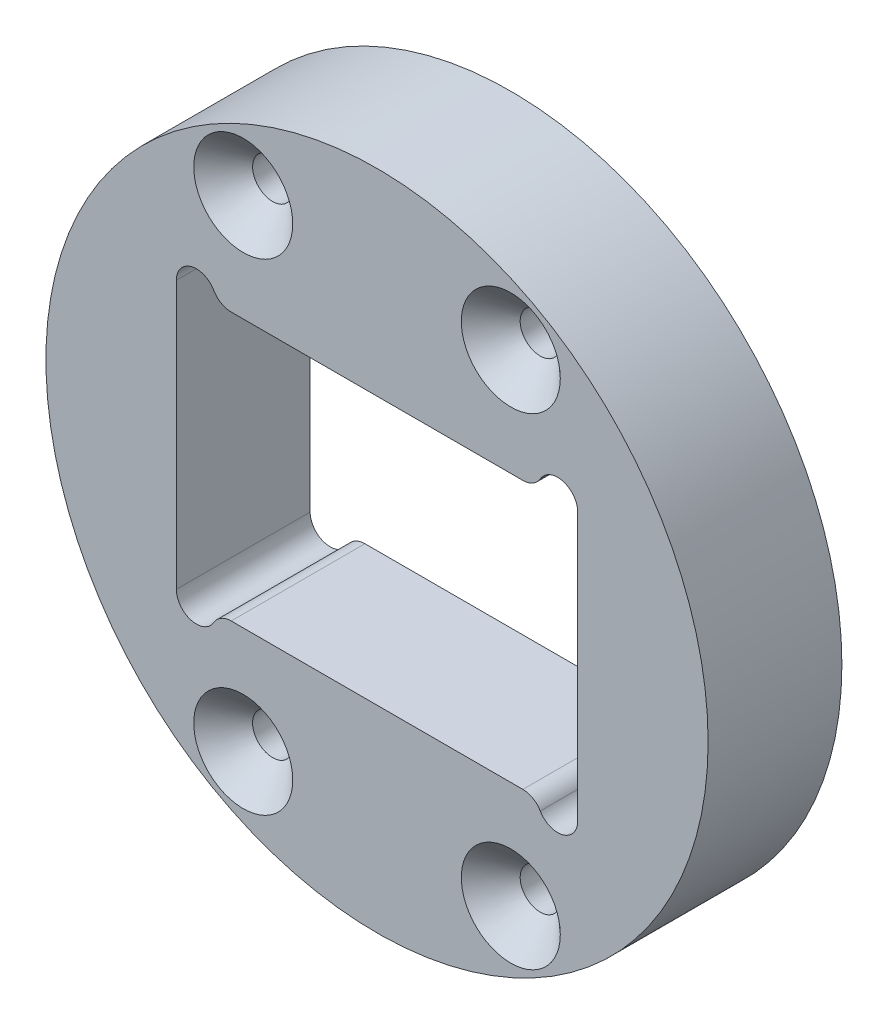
ISO-10303-21;
HEADER;
FILE_DESCRIPTION(('STEP AP214'),'2;1');
FILE_NAME('part.step','',(''),(''),'','','');
FILE_SCHEMA(('AUTOMOTIVE_DESIGN { 1 0 10303 214 1 1 1 1 }'));
ENDSEC;
DATA;
#1=APPLICATION_CONTEXT('core data for automotive mechanical design processes');
#2=APPLICATION_PROTOCOL_DEFINITION('international standard','automotive_design',2000,#1);
#3=PRODUCT_CONTEXT('',#1,'mechanical');
#4=PRODUCT('Part','Part','',(#3));
#5=PRODUCT_RELATED_PRODUCT_CATEGORY('part','',(#4));
#6=PRODUCT_DEFINITION_FORMATION('','',#4);
#7=PRODUCT_DEFINITION_CONTEXT('part definition',#1,'design');
#8=PRODUCT_DEFINITION('design','',#6,#7);
#9=PRODUCT_DEFINITION_SHAPE('','',#8);
#10=(LENGTH_UNIT() NAMED_UNIT(*) SI_UNIT(.MILLI.,.METRE.));
#11=(NAMED_UNIT(*) PLANE_ANGLE_UNIT() SI_UNIT($,.RADIAN.));
#12=(NAMED_UNIT(*) SI_UNIT($,.STERADIAN.) SOLID_ANGLE_UNIT());
#13=UNCERTAINTY_MEASURE_WITH_UNIT(LENGTH_MEASURE(1.E-05),#10,'distance_accuracy_value','');
#14=(GEOMETRIC_REPRESENTATION_CONTEXT(3) GLOBAL_UNCERTAINTY_ASSIGNED_CONTEXT((#13)) GLOBAL_UNIT_ASSIGNED_CONTEXT((#10,
#11,#12)) REPRESENTATION_CONTEXT('',''));
#15=CARTESIAN_POINT('',(0.,0.,0.));
#16=DIRECTION('',(0.,0.,1.));
#17=DIRECTION('',(1.,0.,0.));
#18=AXIS2_PLACEMENT_3D('',#15,#16,#17);
#19=CARTESIAN_POINT('',(0.,0.,10.));
#20=DIRECTION('',(0.,0.,1.));
#21=DIRECTION('',(1.,0.,0.));
#22=AXIS2_PLACEMENT_3D('',#19,#20,#21);
#23=PLANE('',#22);
#24=CARTESIAN_POINT('',(-10.,-18.,10.));
#25=DIRECTION('',(0.,0.,1.));
#26=DIRECTION('',(1.,0.,0.));
#27=AXIS2_PLACEMENT_3D('',#24,#25,#26);
#28=CIRCLE('',#27,3.70000000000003);
#29=CARTESIAN_POINT('',(-6.29999999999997,-18.,10.));
#30=VERTEX_POINT('',#29);
#31=EDGE_CURVE('E291',#30,#30,#28,.F.);
#32=ORIENTED_EDGE('',*,*,#31,.T.);
#33=EDGE_LOOP('',(#32));
#34=FACE_BOUND('',#33,.T.);
#35=CARTESIAN_POINT('',(10.,-18.,10.));
#36=DIRECTION('',(0.,0.,1.));
#37=DIRECTION('',(1.,0.,0.));
#38=AXIS2_PLACEMENT_3D('',#35,#36,#37);
#39=CIRCLE('',#38,3.70000000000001);
#40=CARTESIAN_POINT('',(13.7,-18.,10.));
#41=VERTEX_POINT('',#40);
#42=EDGE_CURVE('E287',#41,#41,#39,.F.);
#43=ORIENTED_EDGE('',*,*,#42,.T.);
#44=EDGE_LOOP('',(#43));
#45=FACE_BOUND('',#44,.T.);
#46=CARTESIAN_POINT('',(10.,18.,10.));
#47=DIRECTION('',(0.,0.,1.));
#48=DIRECTION('',(1.,0.,0.));
#49=AXIS2_PLACEMENT_3D('',#46,#47,#48);
#50=CIRCLE('',#49,3.70000000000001);
#51=CARTESIAN_POINT('',(13.7,18.,10.));
#52=VERTEX_POINT('',#51);
#53=EDGE_CURVE('E283',#52,#52,#50,.F.);
#54=ORIENTED_EDGE('',*,*,#53,.T.);
#55=EDGE_LOOP('',(#54));
#56=FACE_BOUND('',#55,.T.);
#57=CARTESIAN_POINT('',(-10.,18.,10.));
#58=DIRECTION('',(0.,0.,1.));
#59=DIRECTION('',(1.,0.,0.));
#60=AXIS2_PLACEMENT_3D('',#57,#58,#59);
#61=CIRCLE('',#60,3.70000000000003);
#62=CARTESIAN_POINT('',(-6.29999999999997,18.,10.));
#63=VERTEX_POINT('',#62);
#64=EDGE_CURVE('E279',#63,#63,#61,.F.);
#65=ORIENTED_EDGE('',*,*,#64,.T.);
#66=EDGE_LOOP('',(#65));
#67=FACE_BOUND('',#66,.T.);
#68=CARTESIAN_POINT('',(0.,0.,10.));
#69=DIRECTION('',(0.,0.,1.));
#70=DIRECTION('',(1.,0.,0.));
#71=AXIS2_PLACEMENT_3D('',#68,#69,#70);
#72=CIRCLE('',#71,24.75);
#73=CARTESIAN_POINT('',(24.75,0.,10.));
#74=VERTEX_POINT('',#73);
#75=EDGE_CURVE('E268',#74,#74,#72,.T.);
#76=ORIENTED_EDGE('',*,*,#75,.T.);
#77=EDGE_LOOP('',(#76));
#78=FACE_BOUND('',#77,.T.);
#79=DIRECTION('',(0.,-1.,0.));
#80=VECTOR('',#79,1.);
#81=CARTESIAN_POINT('',(-15.,-10.0000000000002,10.));
#82=LINE('',#81,#80);
#83=CARTESIAN_POINT('',(-15.,10.,10.));
#84=VERTEX_POINT('',#83);
#85=CARTESIAN_POINT('',(-15.,-10.0000000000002,10.));
#86=VERTEX_POINT('',#85);
#87=EDGE_CURVE('E146',#84,#86,#82,.T.);
#88=ORIENTED_EDGE('',*,*,#87,.F.);
#89=CARTESIAN_POINT('',(-13.5,10.,10.));
#90=DIRECTION('',(0.,0.,1.));
#91=DIRECTION('',(1.,0.,0.));
#92=AXIS2_PLACEMENT_3D('',#89,#90,#91);
#93=CIRCLE('',#92,1.5);
#94=CARTESIAN_POINT('',(-12.2009618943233,10.75,10.));
#95=VERTEX_POINT('',#94);
#96=EDGE_CURVE('E137',#95,#84,#93,.T.);
#97=ORIENTED_EDGE('',*,*,#96,.F.);
#98=CARTESIAN_POINT('',(-10.9019237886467,11.5,10.));
#99=DIRECTION('',(0.,0.,-1.));
#100=DIRECTION('',(1.,0.,0.));
#101=AXIS2_PLACEMENT_3D('',#98,#99,#100);
#102=CIRCLE('',#101,1.5);
#103=CARTESIAN_POINT('',(-10.9019237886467,10.,10.));
#104=VERTEX_POINT('',#103);
#105=EDGE_CURVE('E191',#104,#95,#102,.T.);
#106=ORIENTED_EDGE('',*,*,#105,.F.);
#107=DIRECTION('',(-1.,0.,0.));
#108=VECTOR('',#107,1.);
#109=CARTESIAN_POINT('',(-10.9019237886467,10.,10.));
#110=LINE('',#109,#108);
#111=CARTESIAN_POINT('',(10.9019237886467,10.,10.));
#112=VERTEX_POINT('',#111);
#113=EDGE_CURVE('E188',#112,#104,#110,.T.);
#114=ORIENTED_EDGE('',*,*,#113,.F.);
#115=CARTESIAN_POINT('',(10.9019237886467,11.5,10.));
#116=DIRECTION('',(0.,0.,-1.));
#117=DIRECTION('',(1.,0.,0.));
#118=AXIS2_PLACEMENT_3D('',#115,#116,#117);
#119=CIRCLE('',#118,1.5);
#120=CARTESIAN_POINT('',(12.2009618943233,10.75,10.));
#121=VERTEX_POINT('',#120);
#122=EDGE_CURVE('E185',#121,#112,#119,.T.);
#123=ORIENTED_EDGE('',*,*,#122,.F.);
#124=CARTESIAN_POINT('',(13.5,10.,10.));
#125=DIRECTION('',(0.,0.,1.));
#126=DIRECTION('',(1.,0.,0.));
#127=AXIS2_PLACEMENT_3D('',#124,#125,#126);
#128=CIRCLE('',#127,1.5);
#129=CARTESIAN_POINT('',(15.,10.,10.));
#130=VERTEX_POINT('',#129);
#131=EDGE_CURVE('E182',#130,#121,#128,.T.);
#132=ORIENTED_EDGE('',*,*,#131,.F.);
#133=DIRECTION('',(0.,1.,0.));
#134=VECTOR('',#133,1.);
#135=CARTESIAN_POINT('',(15.,10.,10.));
#136=LINE('',#135,#134);
#137=CARTESIAN_POINT('',(15.,-10.0000000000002,10.));
#138=VERTEX_POINT('',#137);
#139=EDGE_CURVE('E179',#138,#130,#136,.T.);
#140=ORIENTED_EDGE('',*,*,#139,.F.);
#141=CARTESIAN_POINT('',(13.5,-10.0000000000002,10.));
#142=DIRECTION('',(0.,0.,1.));
#143=DIRECTION('',(1.,0.,0.));
#144=AXIS2_PLACEMENT_3D('',#141,#142,#143);
#145=CIRCLE('',#144,1.5);
#146=CARTESIAN_POINT('',(12.2009618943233,-10.7500000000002,10.));
#147=VERTEX_POINT('',#146);
#148=EDGE_CURVE('E176',#147,#138,#145,.T.);
#149=ORIENTED_EDGE('',*,*,#148,.F.);
#150=CARTESIAN_POINT('',(10.9019237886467,-11.5000000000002,10.));
#151=DIRECTION('',(0.,0.,-1.));
#152=DIRECTION('',(1.,0.,0.));
#153=AXIS2_PLACEMENT_3D('',#150,#151,#152);
#154=CIRCLE('',#153,1.5);
#155=CARTESIAN_POINT('',(10.9019237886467,-10.0000000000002,10.));
#156=VERTEX_POINT('',#155);
#157=EDGE_CURVE('E173',#156,#147,#154,.T.);
#158=ORIENTED_EDGE('',*,*,#157,.F.);
#159=DIRECTION('',(1.,0.,0.));
#160=VECTOR('',#159,1.);
#161=CARTESIAN_POINT('',(10.9019237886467,-10.0000000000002,10.));
#162=LINE('',#161,#160);
#163=CARTESIAN_POINT('',(-10.9019237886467,-10.0000000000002,10.));
#164=VERTEX_POINT('',#163);
#165=EDGE_CURVE('E170',#164,#156,#162,.T.);
#166=ORIENTED_EDGE('',*,*,#165,.F.);
#167=CARTESIAN_POINT('',(-10.9019237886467,-11.5000000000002,10.));
#168=DIRECTION('',(0.,0.,-1.));
#169=DIRECTION('',(1.,0.,0.));
#170=AXIS2_PLACEMENT_3D('',#167,#168,#169);
#171=CIRCLE('',#170,1.5);
#172=CARTESIAN_POINT('',(-12.2009618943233,-10.7500000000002,10.));
#173=VERTEX_POINT('',#172);
#174=EDGE_CURVE('E164',#173,#164,#171,.T.);
#175=ORIENTED_EDGE('',*,*,#174,.F.);
#176=CARTESIAN_POINT('',(-13.5,-10.0000000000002,10.));
#177=DIRECTION('',(0.,0.,1.));
#178=DIRECTION('',(1.,0.,0.));
#179=AXIS2_PLACEMENT_3D('',#176,#177,#178);
#180=CIRCLE('',#179,1.5);
#181=EDGE_CURVE('E160',#86,#173,#180,.T.);
#182=ORIENTED_EDGE('',*,*,#181,.F.);
#183=EDGE_LOOP('',(#88,#97,#106,#114,#123,#132,#140,#149,#158,#166,#175,#182));
#184=FACE_BOUND('',#183,.T.);
#185=ADVANCED_FACE('F46',(#34,#45,#56,#67,#78,#184),#23,.T.);
#186=CARTESIAN_POINT('',(0.,0.,0.));
#187=DIRECTION('',(0.,0.,1.));
#188=DIRECTION('',(1.,0.,0.));
#189=AXIS2_PLACEMENT_3D('',#186,#187,#188);
#190=PLANE('',#189);
#191=CARTESIAN_POINT('',(0.,0.,0.));
#192=DIRECTION('',(0.,0.,1.));
#193=DIRECTION('',(1.,0.,0.));
#194=AXIS2_PLACEMENT_3D('',#191,#192,#193);
#195=CIRCLE('',#194,24.75);
#196=CARTESIAN_POINT('',(24.75,0.,0.));
#197=VERTEX_POINT('',#196);
#198=EDGE_CURVE('E155',#197,#197,#195,.T.);
#199=ORIENTED_EDGE('',*,*,#198,.F.);
#200=EDGE_LOOP('',(#199));
#201=FACE_BOUND('',#200,.T.);
#202=CARTESIAN_POINT('',(-13.5,10.,0.));
#203=DIRECTION('',(0.,0.,1.));
#204=DIRECTION('',(1.,0.,0.));
#205=AXIS2_PLACEMENT_3D('',#202,#203,#204);
#206=CIRCLE('',#205,1.5);
#207=CARTESIAN_POINT('',(-12.2009618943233,10.75,0.));
#208=VERTEX_POINT('',#207);
#209=CARTESIAN_POINT('',(-15.,10.,0.));
#210=VERTEX_POINT('',#209);
#211=EDGE_CURVE('E71',#208,#210,#206,.T.);
#212=ORIENTED_EDGE('',*,*,#211,.T.);
#213=DIRECTION('',(0.,-1.,0.));
#214=VECTOR('',#213,1.);
#215=CARTESIAN_POINT('',(-15.,-10.0000000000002,0.));
#216=LINE('',#215,#214);
#217=CARTESIAN_POINT('',(-15.,-10.0000000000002,0.));
#218=VERTEX_POINT('',#217);
#219=EDGE_CURVE('E153',#210,#218,#216,.T.);
#220=ORIENTED_EDGE('',*,*,#219,.T.);
#221=CARTESIAN_POINT('',(-13.5,-10.0000000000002,0.));
#222=DIRECTION('',(0.,0.,1.));
#223=DIRECTION('',(1.,0.,0.));
#224=AXIS2_PLACEMENT_3D('',#221,#222,#223);
#225=CIRCLE('',#224,1.5);
#226=CARTESIAN_POINT('',(-12.2009618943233,-10.7500000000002,0.));
#227=VERTEX_POINT('',#226);
#228=EDGE_CURVE('E199',#218,#227,#225,.T.);
#229=ORIENTED_EDGE('',*,*,#228,.T.);
#230=CARTESIAN_POINT('',(-10.9019237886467,-11.5000000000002,0.));
#231=DIRECTION('',(0.,0.,-1.));
#232=DIRECTION('',(1.,0.,0.));
#233=AXIS2_PLACEMENT_3D('',#230,#231,#232);
#234=CIRCLE('',#233,1.5);
#235=CARTESIAN_POINT('',(-10.9019237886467,-10.0000000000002,0.));
#236=VERTEX_POINT('',#235);
#237=EDGE_CURVE('E203',#227,#236,#234,.T.);
#238=ORIENTED_EDGE('',*,*,#237,.T.);
#239=DIRECTION('',(1.,0.,0.));
#240=VECTOR('',#239,1.);
#241=CARTESIAN_POINT('',(10.9019237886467,-10.0000000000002,0.));
#242=LINE('',#241,#240);
#243=CARTESIAN_POINT('',(10.9019237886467,-10.0000000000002,0.));
#244=VERTEX_POINT('',#243);
#245=EDGE_CURVE('E207',#236,#244,#242,.T.);
#246=ORIENTED_EDGE('',*,*,#245,.T.);
#247=CARTESIAN_POINT('',(10.9019237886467,-11.5000000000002,0.));
#248=DIRECTION('',(0.,0.,-1.));
#249=DIRECTION('',(1.,0.,0.));
#250=AXIS2_PLACEMENT_3D('',#247,#248,#249);
#251=CIRCLE('',#250,1.5);
#252=CARTESIAN_POINT('',(12.2009618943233,-10.7500000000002,0.));
#253=VERTEX_POINT('',#252);
#254=EDGE_CURVE('E211',#244,#253,#251,.T.);
#255=ORIENTED_EDGE('',*,*,#254,.T.);
#256=CARTESIAN_POINT('',(13.5,-10.0000000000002,0.));
#257=DIRECTION('',(0.,0.,1.));
#258=DIRECTION('',(1.,0.,0.));
#259=AXIS2_PLACEMENT_3D('',#256,#257,#258);
#260=CIRCLE('',#259,1.5);
#261=CARTESIAN_POINT('',(15.,-10.0000000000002,0.));
#262=VERTEX_POINT('',#261);
#263=EDGE_CURVE('E215',#253,#262,#260,.T.);
#264=ORIENTED_EDGE('',*,*,#263,.T.);
#265=DIRECTION('',(0.,1.,0.));
#266=VECTOR('',#265,1.);
#267=CARTESIAN_POINT('',(15.,10.,0.));
#268=LINE('',#267,#266);
#269=CARTESIAN_POINT('',(15.,10.,0.));
#270=VERTEX_POINT('',#269);
#271=EDGE_CURVE('E219',#262,#270,#268,.T.);
#272=ORIENTED_EDGE('',*,*,#271,.T.);
#273=CARTESIAN_POINT('',(13.5,10.,0.));
#274=DIRECTION('',(0.,0.,1.));
#275=DIRECTION('',(1.,0.,0.));
#276=AXIS2_PLACEMENT_3D('',#273,#274,#275);
#277=CIRCLE('',#276,1.5);
#278=CARTESIAN_POINT('',(12.2009618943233,10.75,0.));
#279=VERTEX_POINT('',#278);
#280=EDGE_CURVE('E223',#270,#279,#277,.T.);
#281=ORIENTED_EDGE('',*,*,#280,.T.);
#282=CARTESIAN_POINT('',(10.9019237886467,11.5,0.));
#283=DIRECTION('',(0.,0.,-1.));
#284=DIRECTION('',(1.,0.,0.));
#285=AXIS2_PLACEMENT_3D('',#282,#283,#284);
#286=CIRCLE('',#285,1.5);
#287=CARTESIAN_POINT('',(10.9019237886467,10.,0.));
#288=VERTEX_POINT('',#287);
#289=EDGE_CURVE('E227',#279,#288,#286,.T.);
#290=ORIENTED_EDGE('',*,*,#289,.T.);
#291=DIRECTION('',(-1.,0.,0.));
#292=VECTOR('',#291,1.);
#293=CARTESIAN_POINT('',(-10.9019237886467,10.,0.));
#294=LINE('',#293,#292);
#295=CARTESIAN_POINT('',(-10.9019237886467,10.,0.));
#296=VERTEX_POINT('',#295);
#297=EDGE_CURVE('E231',#288,#296,#294,.T.);
#298=ORIENTED_EDGE('',*,*,#297,.T.);
#299=CARTESIAN_POINT('',(-10.9019237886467,11.5,0.));
#300=DIRECTION('',(0.,0.,-1.));
#301=DIRECTION('',(1.,0.,0.));
#302=AXIS2_PLACEMENT_3D('',#299,#300,#301);
#303=CIRCLE('',#302,1.5);
#304=EDGE_CURVE('E147',#296,#208,#303,.T.);
#305=ORIENTED_EDGE('',*,*,#304,.T.);
#306=EDGE_LOOP('',(#212,#220,#229,#238,#246,#255,#264,#272,#281,#290,#298,#305));
#307=FACE_BOUND('',#306,.T.);
#308=CARTESIAN_POINT('',(10.,18.,0.));
#309=DIRECTION('',(0.,0.,1.));
#310=DIRECTION('',(1.,0.,0.));
#311=AXIS2_PLACEMENT_3D('',#308,#309,#310);
#312=CIRCLE('',#311,1.5);
#313=CARTESIAN_POINT('',(11.5,18.,0.));
#314=VERTEX_POINT('',#313);
#315=EDGE_CURVE('E196',#314,#314,#312,.T.);
#316=ORIENTED_EDGE('',*,*,#315,.T.);
#317=EDGE_LOOP('',(#316));
#318=FACE_BOUND('',#317,.T.);
#319=CARTESIAN_POINT('',(10.,-18.,0.));
#320=DIRECTION('',(0.,0.,1.));
#321=DIRECTION('',(-1.,0.,0.));
#322=AXIS2_PLACEMENT_3D('',#319,#320,#321);
#323=CIRCLE('',#322,1.5);
#324=CARTESIAN_POINT('',(8.49999999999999,-18.,0.));
#325=VERTEX_POINT('',#324);
#326=EDGE_CURVE('E370',#325,#325,#323,.T.);
#327=ORIENTED_EDGE('',*,*,#326,.T.);
#328=EDGE_LOOP('',(#327));
#329=FACE_BOUND('',#328,.T.);
#330=CARTESIAN_POINT('',(-10.,18.,0.));
#331=DIRECTION('',(0.,0.,1.));
#332=DIRECTION('',(1.,0.,0.));
#333=AXIS2_PLACEMENT_3D('',#330,#331,#332);
#334=CIRCLE('',#333,1.5);
#335=CARTESIAN_POINT('',(-8.49999999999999,18.,0.));
#336=VERTEX_POINT('',#335);
#337=EDGE_CURVE('E366',#336,#336,#334,.T.);
#338=ORIENTED_EDGE('',*,*,#337,.T.);
#339=EDGE_LOOP('',(#338));
#340=FACE_BOUND('',#339,.T.);
#341=CARTESIAN_POINT('',(-10.,-18.,0.));
#342=DIRECTION('',(0.,0.,1.));
#343=DIRECTION('',(-1.,0.,0.));
#344=AXIS2_PLACEMENT_3D('',#341,#342,#343);
#345=CIRCLE('',#344,1.5);
#346=CARTESIAN_POINT('',(-11.5,-18.,0.));
#347=VERTEX_POINT('',#346);
#348=EDGE_CURVE('E363',#347,#347,#345,.T.);
#349=ORIENTED_EDGE('',*,*,#348,.T.);
#350=EDGE_LOOP('',(#349));
#351=FACE_BOUND('',#350,.T.);
#352=ADVANCED_FACE('F320',(#201,#307,#318,#329,#340,#351),#190,.F.);
#353=CARTESIAN_POINT('',(0.,0.,10.));
#354=DIRECTION('',(0.,0.,-1.));
#355=DIRECTION('',(-1.,0.,0.));
#356=AXIS2_PLACEMENT_3D('',#353,#354,#355);
#357=CYLINDRICAL_SURFACE('',#356,24.75);
#358=ORIENTED_EDGE('',*,*,#75,.F.);
#359=EDGE_LOOP('',(#358));
#360=FACE_BOUND('',#359,.T.);
#361=ORIENTED_EDGE('',*,*,#198,.T.);
#362=EDGE_LOOP('',(#361));
#363=FACE_BOUND('',#362,.T.);
#364=ADVANCED_FACE('F328',(#360,#363),#357,.T.);
#365=CARTESIAN_POINT('',(-13.5,10.,10.));
#366=DIRECTION('',(0.,0.,-1.));
#367=DIRECTION('',(-1.,0.,0.));
#368=AXIS2_PLACEMENT_3D('',#365,#366,#367);
#369=CYLINDRICAL_SURFACE('',#368,1.5);
#370=ORIENTED_EDGE('',*,*,#211,.F.);
#371=DIRECTION('',(0.,0.,-1.));
#372=VECTOR('',#371,1.);
#373=CARTESIAN_POINT('',(-12.2009618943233,10.75,10.));
#374=LINE('',#373,#372);
#375=EDGE_CURVE('E141',#95,#208,#374,.T.);
#376=ORIENTED_EDGE('',*,*,#375,.F.);
#377=ORIENTED_EDGE('',*,*,#96,.T.);
#378=DIRECTION('',(0.,0.,-1.));
#379=VECTOR('',#378,1.);
#380=CARTESIAN_POINT('',(-15.,10.,10.));
#381=LINE('',#380,#379);
#382=EDGE_CURVE('E140',#84,#210,#381,.T.);
#383=ORIENTED_EDGE('',*,*,#382,.T.);
#384=EDGE_LOOP('',(#370,#376,#377,#383));
#385=FACE_BOUND('',#384,.T.);
#386=ADVANCED_FACE('F139',(#385),#369,.F.);
#387=CARTESIAN_POINT('',(-15.,-10.0000000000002,10.));
#388=DIRECTION('',(1.,0.,0.));
#389=DIRECTION('',(0.,0.,-1.));
#390=AXIS2_PLACEMENT_3D('',#387,#388,#389);
#391=PLANE('',#390);
#392=ORIENTED_EDGE('',*,*,#219,.F.);
#393=ORIENTED_EDGE('',*,*,#382,.F.);
#394=ORIENTED_EDGE('',*,*,#87,.T.);
#395=DIRECTION('',(0.,0.,-1.));
#396=VECTOR('',#395,1.);
#397=CARTESIAN_POINT('',(-15.,-10.0000000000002,10.));
#398=LINE('',#397,#396);
#399=EDGE_CURVE('E156',#86,#218,#398,.T.);
#400=ORIENTED_EDGE('',*,*,#399,.T.);
#401=EDGE_LOOP('',(#392,#393,#394,#400));
#402=FACE_BOUND('',#401,.T.);
#403=ADVANCED_FACE('F150',(#402),#391,.T.);
#404=CARTESIAN_POINT('',(-13.5,-10.0000000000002,10.));
#405=DIRECTION('',(0.,0.,-1.));
#406=DIRECTION('',(-1.,0.,0.));
#407=AXIS2_PLACEMENT_3D('',#404,#405,#406);
#408=CYLINDRICAL_SURFACE('',#407,1.5);
#409=ORIENTED_EDGE('',*,*,#228,.F.);
#410=ORIENTED_EDGE('',*,*,#399,.F.);
#411=ORIENTED_EDGE('',*,*,#181,.T.);
#412=DIRECTION('',(0.,0.,-1.));
#413=VECTOR('',#412,1.);
#414=CARTESIAN_POINT('',(-12.2009618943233,-10.7500000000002,10.));
#415=LINE('',#414,#413);
#416=EDGE_CURVE('E263',#173,#227,#415,.T.);
#417=ORIENTED_EDGE('',*,*,#416,.T.);
#418=EDGE_LOOP('',(#409,#410,#411,#417));
#419=FACE_BOUND('',#418,.T.);
#420=ADVANCED_FACE('F422',(#419),#408,.F.);
#421=CARTESIAN_POINT('',(-10.9019237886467,-11.5000000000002,10.));
#422=DIRECTION('',(0.,0.,-1.));
#423=DIRECTION('',(-1.,0.,0.));
#424=AXIS2_PLACEMENT_3D('',#421,#422,#423);
#425=CYLINDRICAL_SURFACE('',#424,1.5);
#426=ORIENTED_EDGE('',*,*,#237,.F.);
#427=ORIENTED_EDGE('',*,*,#416,.F.);
#428=ORIENTED_EDGE('',*,*,#174,.T.);
#429=DIRECTION('',(0.,0.,-1.));
#430=VECTOR('',#429,1.);
#431=CARTESIAN_POINT('',(-10.9019237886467,-10.0000000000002,10.));
#432=LINE('',#431,#430);
#433=EDGE_CURVE('E260',#164,#236,#432,.T.);
#434=ORIENTED_EDGE('',*,*,#433,.T.);
#435=EDGE_LOOP('',(#426,#427,#428,#434));
#436=FACE_BOUND('',#435,.T.);
#437=ADVANCED_FACE('F418',(#436),#425,.T.);
#438=CARTESIAN_POINT('',(10.9019237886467,-10.0000000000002,10.));
#439=DIRECTION('',(0.,1.,0.));
#440=DIRECTION('',(-1.,0.,0.));
#441=AXIS2_PLACEMENT_3D('',#438,#439,#440);
#442=PLANE('',#441);
#443=ORIENTED_EDGE('',*,*,#245,.F.);
#444=ORIENTED_EDGE('',*,*,#433,.F.);
#445=ORIENTED_EDGE('',*,*,#165,.T.);
#446=DIRECTION('',(0.,0.,-1.));
#447=VECTOR('',#446,1.);
#448=CARTESIAN_POINT('',(10.9019237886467,-10.0000000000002,10.));
#449=LINE('',#448,#447);
#450=EDGE_CURVE('E257',#156,#244,#449,.T.);
#451=ORIENTED_EDGE('',*,*,#450,.T.);
#452=EDGE_LOOP('',(#443,#444,#445,#451));
#453=FACE_BOUND('',#452,.T.);
#454=ADVANCED_FACE('F414',(#453),#442,.T.);
#455=CARTESIAN_POINT('',(10.9019237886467,-11.5000000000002,10.));
#456=DIRECTION('',(0.,0.,-1.));
#457=DIRECTION('',(-1.,0.,0.));
#458=AXIS2_PLACEMENT_3D('',#455,#456,#457);
#459=CYLINDRICAL_SURFACE('',#458,1.5);
#460=ORIENTED_EDGE('',*,*,#254,.F.);
#461=ORIENTED_EDGE('',*,*,#450,.F.);
#462=ORIENTED_EDGE('',*,*,#157,.T.);
#463=DIRECTION('',(0.,0.,-1.));
#464=VECTOR('',#463,1.);
#465=CARTESIAN_POINT('',(12.2009618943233,-10.7500000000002,10.));
#466=LINE('',#465,#464);
#467=EDGE_CURVE('E254',#147,#253,#466,.T.);
#468=ORIENTED_EDGE('',*,*,#467,.T.);
#469=EDGE_LOOP('',(#460,#461,#462,#468));
#470=FACE_BOUND('',#469,.T.);
#471=ADVANCED_FACE('F410',(#470),#459,.T.);
#472=CARTESIAN_POINT('',(13.5,-10.0000000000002,10.));
#473=DIRECTION('',(0.,0.,-1.));
#474=DIRECTION('',(-1.,0.,0.));
#475=AXIS2_PLACEMENT_3D('',#472,#473,#474);
#476=CYLINDRICAL_SURFACE('',#475,1.5);
#477=ORIENTED_EDGE('',*,*,#263,.F.);
#478=ORIENTED_EDGE('',*,*,#467,.F.);
#479=ORIENTED_EDGE('',*,*,#148,.T.);
#480=DIRECTION('',(0.,0.,-1.));
#481=VECTOR('',#480,1.);
#482=CARTESIAN_POINT('',(15.,-10.0000000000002,10.));
#483=LINE('',#482,#481);
#484=EDGE_CURVE('E251',#138,#262,#483,.T.);
#485=ORIENTED_EDGE('',*,*,#484,.T.);
#486=EDGE_LOOP('',(#477,#478,#479,#485));
#487=FACE_BOUND('',#486,.T.);
#488=ADVANCED_FACE('F406',(#487),#476,.F.);
#489=CARTESIAN_POINT('',(15.,10.,10.));
#490=DIRECTION('',(-1.,0.,0.));
#491=DIRECTION('',(0.,-1.,0.));
#492=AXIS2_PLACEMENT_3D('',#489,#490,#491);
#493=PLANE('',#492);
#494=ORIENTED_EDGE('',*,*,#271,.F.);
#495=ORIENTED_EDGE('',*,*,#484,.F.);
#496=ORIENTED_EDGE('',*,*,#139,.T.);
#497=DIRECTION('',(0.,0.,-1.));
#498=VECTOR('',#497,1.);
#499=CARTESIAN_POINT('',(15.,10.,10.));
#500=LINE('',#499,#498);
#501=EDGE_CURVE('E248',#130,#270,#500,.T.);
#502=ORIENTED_EDGE('',*,*,#501,.T.);
#503=EDGE_LOOP('',(#494,#495,#496,#502));
#504=FACE_BOUND('',#503,.T.);
#505=ADVANCED_FACE('F402',(#504),#493,.T.);
#506=CARTESIAN_POINT('',(13.5,10.,10.));
#507=DIRECTION('',(0.,0.,-1.));
#508=DIRECTION('',(-1.,0.,0.));
#509=AXIS2_PLACEMENT_3D('',#506,#507,#508);
#510=CYLINDRICAL_SURFACE('',#509,1.5);
#511=ORIENTED_EDGE('',*,*,#280,.F.);
#512=ORIENTED_EDGE('',*,*,#501,.F.);
#513=ORIENTED_EDGE('',*,*,#131,.T.);
#514=DIRECTION('',(0.,0.,-1.));
#515=VECTOR('',#514,1.);
#516=CARTESIAN_POINT('',(12.2009618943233,10.75,10.));
#517=LINE('',#516,#515);
#518=EDGE_CURVE('E245',#121,#279,#517,.T.);
#519=ORIENTED_EDGE('',*,*,#518,.T.);
#520=EDGE_LOOP('',(#511,#512,#513,#519));
#521=FACE_BOUND('',#520,.T.);
#522=ADVANCED_FACE('F398',(#521),#510,.F.);
#523=CARTESIAN_POINT('',(10.9019237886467,11.5,10.));
#524=DIRECTION('',(0.,0.,-1.));
#525=DIRECTION('',(-1.,0.,0.));
#526=AXIS2_PLACEMENT_3D('',#523,#524,#525);
#527=CYLINDRICAL_SURFACE('',#526,1.5);
#528=ORIENTED_EDGE('',*,*,#289,.F.);
#529=ORIENTED_EDGE('',*,*,#518,.F.);
#530=ORIENTED_EDGE('',*,*,#122,.T.);
#531=DIRECTION('',(0.,0.,-1.));
#532=VECTOR('',#531,1.);
#533=CARTESIAN_POINT('',(10.9019237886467,10.,10.));
#534=LINE('',#533,#532);
#535=EDGE_CURVE('E242',#112,#288,#534,.T.);
#536=ORIENTED_EDGE('',*,*,#535,.T.);
#537=EDGE_LOOP('',(#528,#529,#530,#536));
#538=FACE_BOUND('',#537,.T.);
#539=ADVANCED_FACE('F394',(#538),#527,.T.);
#540=CARTESIAN_POINT('',(-10.9019237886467,10.,10.));
#541=DIRECTION('',(0.,-1.,0.));
#542=DIRECTION('',(1.,0.,0.));
#543=AXIS2_PLACEMENT_3D('',#540,#541,#542);
#544=PLANE('',#543);
#545=ORIENTED_EDGE('',*,*,#297,.F.);
#546=ORIENTED_EDGE('',*,*,#535,.F.);
#547=ORIENTED_EDGE('',*,*,#113,.T.);
#548=DIRECTION('',(0.,0.,-1.));
#549=VECTOR('',#548,1.);
#550=CARTESIAN_POINT('',(-10.9019237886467,10.,10.));
#551=LINE('',#550,#549);
#552=EDGE_CURVE('E63',#104,#296,#551,.T.);
#553=ORIENTED_EDGE('',*,*,#552,.T.);
#554=EDGE_LOOP('',(#545,#546,#547,#553));
#555=FACE_BOUND('',#554,.T.);
#556=ADVANCED_FACE('F388',(#555),#544,.T.);
#557=CARTESIAN_POINT('',(-10.9019237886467,11.5,10.));
#558=DIRECTION('',(0.,0.,-1.));
#559=DIRECTION('',(-1.,0.,0.));
#560=AXIS2_PLACEMENT_3D('',#557,#558,#559);
#561=CYLINDRICAL_SURFACE('',#560,1.5);
#562=ORIENTED_EDGE('',*,*,#304,.F.);
#563=ORIENTED_EDGE('',*,*,#552,.F.);
#564=ORIENTED_EDGE('',*,*,#105,.T.);
#565=ORIENTED_EDGE('',*,*,#375,.T.);
#566=EDGE_LOOP('',(#562,#563,#564,#565));
#567=FACE_BOUND('',#566,.T.);
#568=ADVANCED_FACE('F381',(#567),#561,.T.);
#569=CARTESIAN_POINT('',(10.,18.,10.));
#570=DIRECTION('',(0.,0.,-1.));
#571=DIRECTION('',(-1.,0.,0.));
#572=AXIS2_PLACEMENT_3D('',#569,#570,#571);
#573=CYLINDRICAL_SURFACE('',#572,1.5);
#574=CARTESIAN_POINT('',(10.,18.,7.80000000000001));
#575=DIRECTION('',(0.,0.,1.));
#576=DIRECTION('',(1.,0.,0.));
#577=AXIS2_PLACEMENT_3D('',#574,#575,#576);
#578=CIRCLE('',#577,1.5);
#579=CARTESIAN_POINT('',(11.5,18.,7.80000000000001));
#580=VERTEX_POINT('',#579);
#581=EDGE_CURVE('E56',#580,#580,#578,.T.);
#582=ORIENTED_EDGE('',*,*,#581,.T.);
#583=EDGE_LOOP('',(#582));
#584=FACE_BOUND('',#583,.T.);
#585=ORIENTED_EDGE('',*,*,#315,.F.);
#586=EDGE_LOOP('',(#585));
#587=FACE_BOUND('',#586,.T.);
#588=ADVANCED_FACE('F302',(#584,#587),#573,.F.);
#589=CARTESIAN_POINT('',(10.,-18.,10.));
#590=DIRECTION('',(0.,0.,-1.));
#591=DIRECTION('',(-1.,0.,0.));
#592=AXIS2_PLACEMENT_3D('',#589,#590,#591);
#593=CYLINDRICAL_SURFACE('',#592,1.5);
#594=CARTESIAN_POINT('',(10.,-18.,7.80000000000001));
#595=DIRECTION('',(0.,0.,1.));
#596=DIRECTION('',(1.,0.,0.));
#597=AXIS2_PLACEMENT_3D('',#594,#595,#596);
#598=CIRCLE('',#597,1.5);
#599=CARTESIAN_POINT('',(11.5,-18.,7.80000000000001));
#600=VERTEX_POINT('',#599);
#601=EDGE_CURVE('E295',#600,#600,#598,.T.);
#602=ORIENTED_EDGE('',*,*,#601,.T.);
#603=EDGE_LOOP('',(#602));
#604=FACE_BOUND('',#603,.T.);
#605=ORIENTED_EDGE('',*,*,#326,.F.);
#606=EDGE_LOOP('',(#605));
#607=FACE_BOUND('',#606,.T.);
#608=ADVANCED_FACE('F380',(#604,#607),#593,.F.);
#609=CARTESIAN_POINT('',(-10.,18.,10.));
#610=DIRECTION('',(0.,0.,-1.));
#611=DIRECTION('',(-1.,0.,0.));
#612=AXIS2_PLACEMENT_3D('',#609,#610,#611);
#613=CYLINDRICAL_SURFACE('',#612,1.5);
#614=CARTESIAN_POINT('',(-10.,18.,7.79999999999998));
#615=DIRECTION('',(0.,0.,1.));
#616=DIRECTION('',(1.,0.,0.));
#617=AXIS2_PLACEMENT_3D('',#614,#615,#616);
#618=CIRCLE('',#617,1.5);
#619=CARTESIAN_POINT('',(-8.49999999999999,18.,7.79999999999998));
#620=VERTEX_POINT('',#619);
#621=EDGE_CURVE('E11',#620,#620,#618,.T.);
#622=ORIENTED_EDGE('',*,*,#621,.T.);
#623=EDGE_LOOP('',(#622));
#624=FACE_BOUND('',#623,.T.);
#625=ORIENTED_EDGE('',*,*,#337,.F.);
#626=EDGE_LOOP('',(#625));
#627=FACE_BOUND('',#626,.T.);
#628=ADVANCED_FACE('F354',(#624,#627),#613,.F.);
#629=CARTESIAN_POINT('',(-10.,-18.,10.));
#630=DIRECTION('',(0.,0.,-1.));
#631=DIRECTION('',(-1.,0.,0.));
#632=AXIS2_PLACEMENT_3D('',#629,#630,#631);
#633=CYLINDRICAL_SURFACE('',#632,1.5);
#634=CARTESIAN_POINT('',(-10.,-18.,7.79999999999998));
#635=DIRECTION('',(0.,0.,1.));
#636=DIRECTION('',(1.,0.,0.));
#637=AXIS2_PLACEMENT_3D('',#634,#635,#636);
#638=CIRCLE('',#637,1.5);
#639=CARTESIAN_POINT('',(-8.49999999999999,-18.,7.79999999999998));
#640=VERTEX_POINT('',#639);
#641=EDGE_CURVE('E272',#640,#640,#638,.T.);
#642=ORIENTED_EDGE('',*,*,#641,.T.);
#643=EDGE_LOOP('',(#642));
#644=FACE_BOUND('',#643,.T.);
#645=ORIENTED_EDGE('',*,*,#348,.F.);
#646=EDGE_LOOP('',(#645));
#647=FACE_BOUND('',#646,.T.);
#648=ADVANCED_FACE('F343',(#644,#647),#633,.F.);
#649=CARTESIAN_POINT('',(-10.,-18.,7.79999999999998));
#650=DIRECTION('',(0.,0.,1.));
#651=DIRECTION('',(1.,0.,0.));
#652=AXIS2_PLACEMENT_3D('',#649,#650,#651);
#653=CONICAL_SURFACE('',#652,1.5,0.78539816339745);
#654=ORIENTED_EDGE('',*,*,#31,.F.);
#655=EDGE_LOOP('',(#654));
#656=FACE_BOUND('',#655,.T.);
#657=ORIENTED_EDGE('',*,*,#641,.F.);
#658=EDGE_LOOP('',(#657));
#659=FACE_BOUND('',#658,.T.);
#660=ADVANCED_FACE('F314',(#656,#659),#653,.F.);
#661=CARTESIAN_POINT('',(10.,-18.,7.80000000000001));
#662=DIRECTION('',(0.,0.,1.));
#663=DIRECTION('',(1.,0.,0.));
#664=AXIS2_PLACEMENT_3D('',#661,#662,#663);
#665=CONICAL_SURFACE('',#664,1.5,0.78539816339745);
#666=ORIENTED_EDGE('',*,*,#42,.F.);
#667=EDGE_LOOP('',(#666));
#668=FACE_BOUND('',#667,.T.);
#669=ORIENTED_EDGE('',*,*,#601,.F.);
#670=EDGE_LOOP('',(#669));
#671=FACE_BOUND('',#670,.T.);
#672=ADVANCED_FACE('F307',(#668,#671),#665,.F.);
#673=CARTESIAN_POINT('',(10.,18.,7.80000000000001));
#674=DIRECTION('',(0.,0.,1.));
#675=DIRECTION('',(1.,0.,0.));
#676=AXIS2_PLACEMENT_3D('',#673,#674,#675);
#677=CONICAL_SURFACE('',#676,1.5,0.78539816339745);
#678=ORIENTED_EDGE('',*,*,#53,.F.);
#679=EDGE_LOOP('',(#678));
#680=FACE_BOUND('',#679,.T.);
#681=ORIENTED_EDGE('',*,*,#581,.F.);
#682=EDGE_LOOP('',(#681));
#683=FACE_BOUND('',#682,.T.);
#684=ADVANCED_FACE('F305',(#680,#683),#677,.F.);
#685=CARTESIAN_POINT('',(-10.,18.,7.79999999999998));
#686=DIRECTION('',(0.,0.,1.));
#687=DIRECTION('',(1.,0.,0.));
#688=AXIS2_PLACEMENT_3D('',#685,#686,#687);
#689=CONICAL_SURFACE('',#688,1.5,0.78539816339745);
#690=ORIENTED_EDGE('',*,*,#64,.F.);
#691=EDGE_LOOP('',(#690));
#692=FACE_BOUND('',#691,.T.);
#693=ORIENTED_EDGE('',*,*,#621,.F.);
#694=EDGE_LOOP('',(#693));
#695=FACE_BOUND('',#694,.T.);
#696=ADVANCED_FACE('F49',(#692,#695),#689,.F.);
#697=CLOSED_SHELL('',(#185,#352,#364,#386,#403,#420,#437,#454,#471,#488,#505,#522,#539,#556,
#568,#588,#608,#628,#648,#660,#672,#684,#696));
#698=MANIFOLD_SOLID_BREP('B2',#697);
#699=ADVANCED_BREP_SHAPE_REPRESENTATION('',(#18,#698),#14);
#700=SHAPE_DEFINITION_REPRESENTATION(#9,#699);
ENDSEC;
END-ISO-10303-21;
